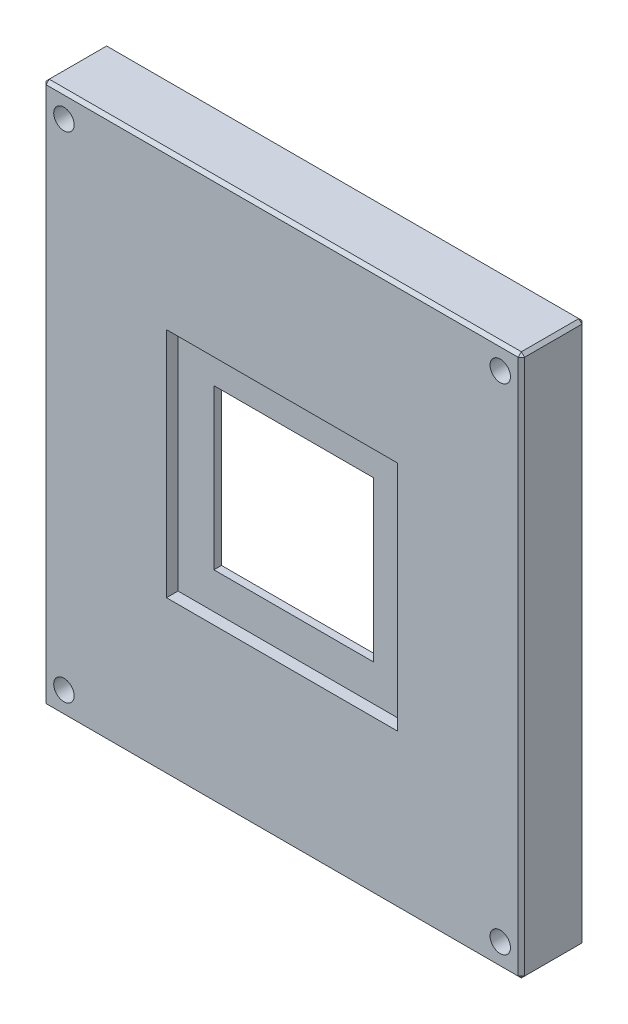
ISO-10303-21;
HEADER;
FILE_DESCRIPTION(('STEP AP214'),'2;1');
FILE_NAME('part.step','',(''),(''),'','','');
FILE_SCHEMA(('AUTOMOTIVE_DESIGN { 1 0 10303 214 1 1 1 1 }'));
ENDSEC;
DATA;
#1=APPLICATION_CONTEXT('core data for automotive mechanical design processes');
#2=APPLICATION_PROTOCOL_DEFINITION('international standard','automotive_design',2000,#1);
#3=PRODUCT_CONTEXT('',#1,'mechanical');
#4=PRODUCT('Part','Part','',(#3));
#5=PRODUCT_RELATED_PRODUCT_CATEGORY('part','',(#4));
#6=PRODUCT_DEFINITION_FORMATION('','',#4);
#7=PRODUCT_DEFINITION_CONTEXT('part definition',#1,'design');
#8=PRODUCT_DEFINITION('design','',#6,#7);
#9=PRODUCT_DEFINITION_SHAPE('','',#8);
#10=(LENGTH_UNIT() NAMED_UNIT(*) SI_UNIT(.MILLI.,.METRE.));
#11=(NAMED_UNIT(*) PLANE_ANGLE_UNIT() SI_UNIT($,.RADIAN.));
#12=(NAMED_UNIT(*) SI_UNIT($,.STERADIAN.) SOLID_ANGLE_UNIT());
#13=UNCERTAINTY_MEASURE_WITH_UNIT(LENGTH_MEASURE(1.E-05),#10,'distance_accuracy_value','');
#14=(GEOMETRIC_REPRESENTATION_CONTEXT(3) GLOBAL_UNCERTAINTY_ASSIGNED_CONTEXT((#13)) GLOBAL_UNIT_ASSIGNED_CONTEXT((#10,
#11,#12)) REPRESENTATION_CONTEXT('',''));
#15=CARTESIAN_POINT('',(0.,0.,0.));
#16=DIRECTION('',(0.,0.,1.));
#17=DIRECTION('',(1.,0.,0.));
#18=AXIS2_PLACEMENT_3D('',#15,#16,#17);
#19=CARTESIAN_POINT('',(0.,0.,10.));
#20=DIRECTION('',(0.,0.,-1.));
#21=DIRECTION('',(-1.,0.,0.));
#22=AXIS2_PLACEMENT_3D('',#19,#20,#21);
#23=PLANE('',#22);
#24=DIRECTION('',(0.,-1.,0.));
#25=VECTOR('',#24,1.);
#26=CARTESIAN_POINT('',(-37.,0.,10.));
#27=LINE('',#26,#25);
#28=CARTESIAN_POINT('',(-37.,42.,10.));
#29=VERTEX_POINT('',#28);
#30=CARTESIAN_POINT('',(-37.,-42.,10.));
#31=VERTEX_POINT('',#30);
#32=EDGE_CURVE('E304',#29,#31,#27,.T.);
#33=ORIENTED_EDGE('',*,*,#32,.T.);
#34=DIRECTION('',(1.,0.,0.));
#35=VECTOR('',#34,1.);
#36=CARTESIAN_POINT('',(0.,-42.,10.));
#37=LINE('',#36,#35);
#38=CARTESIAN_POINT('',(37.,-42.,10.));
#39=VERTEX_POINT('',#38);
#40=EDGE_CURVE('E306',#31,#39,#37,.T.);
#41=ORIENTED_EDGE('',*,*,#40,.T.);
#42=DIRECTION('',(0.,1.,0.));
#43=VECTOR('',#42,1.);
#44=CARTESIAN_POINT('',(37.,0.,10.));
#45=LINE('',#44,#43);
#46=CARTESIAN_POINT('',(37.,42.,10.));
#47=VERTEX_POINT('',#46);
#48=EDGE_CURVE('E300',#39,#47,#45,.T.);
#49=ORIENTED_EDGE('',*,*,#48,.T.);
#50=DIRECTION('',(-1.,0.,0.));
#51=VECTOR('',#50,1.);
#52=CARTESIAN_POINT('',(0.,42.,10.));
#53=LINE('',#52,#51);
#54=EDGE_CURVE('E302',#47,#29,#53,.T.);
#55=ORIENTED_EDGE('',*,*,#54,.T.);
#56=EDGE_LOOP('',(#33,#41,#49,#55));
#57=FACE_BOUND('',#56,.T.);
#58=CARTESIAN_POINT('',(34.1918918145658,38.7508107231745,10.));
#59=DIRECTION('',(0.,0.,-1.));
#60=DIRECTION('',(-1.,0.,0.));
#61=AXIS2_PLACEMENT_3D('',#58,#59,#60);
#62=CIRCLE('',#61,1.60000000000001);
#63=CARTESIAN_POINT('',(32.5918918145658,38.7508107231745,10.));
#64=VERTEX_POINT('',#63);
#65=EDGE_CURVE('E399',#64,#64,#62,.T.);
#66=ORIENTED_EDGE('',*,*,#65,.T.);
#67=EDGE_LOOP('',(#66));
#68=FACE_BOUND('',#67,.T.);
#69=CARTESIAN_POINT('',(34.1918918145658,-38.7508107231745,10.));
#70=DIRECTION('',(0.,0.,1.));
#71=DIRECTION('',(-1.,0.,0.));
#72=AXIS2_PLACEMENT_3D('',#69,#70,#71);
#73=CIRCLE('',#72,1.60000000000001);
#74=CARTESIAN_POINT('',(32.5918918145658,-38.7508107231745,10.));
#75=VERTEX_POINT('',#74);
#76=EDGE_CURVE('E410',#75,#75,#73,.T.);
#77=ORIENTED_EDGE('',*,*,#76,.F.);
#78=EDGE_LOOP('',(#77));
#79=FACE_BOUND('',#78,.T.);
#80=CARTESIAN_POINT('',(-34.1918918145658,-38.7508107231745,10.));
#81=DIRECTION('',(0.,0.,-1.));
#82=DIRECTION('',(1.,0.,0.));
#83=AXIS2_PLACEMENT_3D('',#80,#81,#82);
#84=CIRCLE('',#83,1.60000000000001);
#85=CARTESIAN_POINT('',(-32.5918918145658,-38.7508107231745,10.));
#86=VERTEX_POINT('',#85);
#87=EDGE_CURVE('E416',#86,#86,#84,.T.);
#88=ORIENTED_EDGE('',*,*,#87,.T.);
#89=EDGE_LOOP('',(#88));
#90=FACE_BOUND('',#89,.T.);
#91=CARTESIAN_POINT('',(-34.1918918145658,38.7508107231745,10.));
#92=DIRECTION('',(0.,0.,1.));
#93=DIRECTION('',(1.,0.,0.));
#94=AXIS2_PLACEMENT_3D('',#91,#92,#93);
#95=CIRCLE('',#94,1.60000000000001);
#96=CARTESIAN_POINT('',(-32.5918918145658,38.7508107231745,10.));
#97=VERTEX_POINT('',#96);
#98=EDGE_CURVE('E422',#97,#97,#95,.T.);
#99=ORIENTED_EDGE('',*,*,#98,.F.);
#100=EDGE_LOOP('',(#99));
#101=FACE_BOUND('',#100,.T.);
#102=DIRECTION('',(-1.,0.,0.));
#103=VECTOR('',#102,1.);
#104=CARTESIAN_POINT('',(-18.12,18.195,10.));
#105=LINE('',#104,#103);
#106=CARTESIAN_POINT('',(18.12,18.195,10.));
#107=VERTEX_POINT('',#106);
#108=CARTESIAN_POINT('',(-18.12,18.195,10.));
#109=VERTEX_POINT('',#108);
#110=EDGE_CURVE('E224',#107,#109,#105,.T.);
#111=ORIENTED_EDGE('',*,*,#110,.F.);
#112=DIRECTION('',(0.,1.,0.));
#113=VECTOR('',#112,1.);
#114=CARTESIAN_POINT('',(18.12,-18.195,10.));
#115=LINE('',#114,#113);
#116=CARTESIAN_POINT('',(18.12,-18.195,10.));
#117=VERTEX_POINT('',#116);
#118=EDGE_CURVE('E195',#117,#107,#115,.T.);
#119=ORIENTED_EDGE('',*,*,#118,.F.);
#120=DIRECTION('',(1.,0.,0.));
#121=VECTOR('',#120,1.);
#122=CARTESIAN_POINT('',(-18.12,-18.195,10.));
#123=LINE('',#122,#121);
#124=CARTESIAN_POINT('',(-18.12,-18.195,10.));
#125=VERTEX_POINT('',#124);
#126=EDGE_CURVE('E212',#125,#117,#123,.T.);
#127=ORIENTED_EDGE('',*,*,#126,.F.);
#128=DIRECTION('',(0.,-1.,0.));
#129=VECTOR('',#128,1.);
#130=CARTESIAN_POINT('',(-18.12,-18.195,10.));
#131=LINE('',#130,#129);
#132=EDGE_CURVE('E215',#109,#125,#131,.T.);
#133=ORIENTED_EDGE('',*,*,#132,.F.);
#134=EDGE_LOOP('',(#111,#119,#127,#133));
#135=FACE_BOUND('',#134,.T.);
#136=ADVANCED_FACE('F39',(#57,#68,#79,#90,#101,#135),#23,.F.);
#137=CARTESIAN_POINT('',(0.,0.,0.));
#138=DIRECTION('',(0.,0.,-1.));
#139=DIRECTION('',(-1.,0.,0.));
#140=AXIS2_PLACEMENT_3D('',#137,#138,#139);
#141=PLANE('',#140);
#142=DIRECTION('',(0.,-1.,0.));
#143=VECTOR('',#142,1.);
#144=CARTESIAN_POINT('',(37.,-42.5,0.));
#145=LINE('',#144,#143);
#146=CARTESIAN_POINT('',(37.,42.,0.));
#147=VERTEX_POINT('',#146);
#148=CARTESIAN_POINT('',(37.,-42.,0.));
#149=VERTEX_POINT('',#148);
#150=EDGE_CURVE('E291',#147,#149,#145,.T.);
#151=ORIENTED_EDGE('',*,*,#150,.T.);
#152=DIRECTION('',(-1.,0.,0.));
#153=VECTOR('',#152,1.);
#154=CARTESIAN_POINT('',(-37.5,-42.,0.));
#155=LINE('',#154,#153);
#156=CARTESIAN_POINT('',(-37.,-42.,0.));
#157=VERTEX_POINT('',#156);
#158=EDGE_CURVE('E297',#149,#157,#155,.T.);
#159=ORIENTED_EDGE('',*,*,#158,.T.);
#160=DIRECTION('',(0.,1.,0.));
#161=VECTOR('',#160,1.);
#162=CARTESIAN_POINT('',(-37.,42.5,0.));
#163=LINE('',#162,#161);
#164=CARTESIAN_POINT('',(-37.,42.,0.));
#165=VERTEX_POINT('',#164);
#166=EDGE_CURVE('E295',#157,#165,#163,.T.);
#167=ORIENTED_EDGE('',*,*,#166,.T.);
#168=DIRECTION('',(1.,0.,0.));
#169=VECTOR('',#168,1.);
#170=CARTESIAN_POINT('',(37.5,42.,0.));
#171=LINE('',#170,#169);
#172=EDGE_CURVE('E293',#165,#147,#171,.T.);
#173=ORIENTED_EDGE('',*,*,#172,.T.);
#174=EDGE_LOOP('',(#151,#159,#167,#173));
#175=FACE_BOUND('',#174,.T.);
#176=CARTESIAN_POINT('',(34.1918918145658,38.7508107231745,0.));
#177=DIRECTION('',(0.,0.,-1.));
#178=DIRECTION('',(-1.,0.,0.));
#179=AXIS2_PLACEMENT_3D('',#176,#177,#178);
#180=CIRCLE('',#179,1.60000000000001);
#181=CARTESIAN_POINT('',(32.5918918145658,38.7508107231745,0.));
#182=VERTEX_POINT('',#181);
#183=EDGE_CURVE('E405',#182,#182,#180,.T.);
#184=ORIENTED_EDGE('',*,*,#183,.F.);
#185=EDGE_LOOP('',(#184));
#186=FACE_BOUND('',#185,.T.);
#187=CARTESIAN_POINT('',(34.1918918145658,-38.7508107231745,0.));
#188=DIRECTION('',(0.,0.,1.));
#189=DIRECTION('',(-1.,0.,0.));
#190=AXIS2_PLACEMENT_3D('',#187,#188,#189);
#191=CIRCLE('',#190,1.60000000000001);
#192=CARTESIAN_POINT('',(32.5918918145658,-38.7508107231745,0.));
#193=VERTEX_POINT('',#192);
#194=EDGE_CURVE('E413',#193,#193,#191,.T.);
#195=ORIENTED_EDGE('',*,*,#194,.T.);
#196=EDGE_LOOP('',(#195));
#197=FACE_BOUND('',#196,.T.);
#198=CARTESIAN_POINT('',(-34.1918918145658,-38.7508107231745,0.));
#199=DIRECTION('',(0.,0.,-1.));
#200=DIRECTION('',(1.,0.,0.));
#201=AXIS2_PLACEMENT_3D('',#198,#199,#200);
#202=CIRCLE('',#201,1.60000000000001);
#203=CARTESIAN_POINT('',(-32.5918918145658,-38.7508107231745,0.));
#204=VERTEX_POINT('',#203);
#205=EDGE_CURVE('E419',#204,#204,#202,.T.);
#206=ORIENTED_EDGE('',*,*,#205,.F.);
#207=EDGE_LOOP('',(#206));
#208=FACE_BOUND('',#207,.T.);
#209=CARTESIAN_POINT('',(-34.1918918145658,38.7508107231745,0.));
#210=DIRECTION('',(0.,0.,1.));
#211=DIRECTION('',(1.,0.,0.));
#212=AXIS2_PLACEMENT_3D('',#209,#210,#211);
#213=CIRCLE('',#212,1.60000000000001);
#214=CARTESIAN_POINT('',(-32.5918918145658,38.7508107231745,0.));
#215=VERTEX_POINT('',#214);
#216=EDGE_CURVE('E425',#215,#215,#213,.T.);
#217=ORIENTED_EDGE('',*,*,#216,.T.);
#218=EDGE_LOOP('',(#217));
#219=FACE_BOUND('',#218,.T.);
#220=DIRECTION('',(0.,-1.,0.));
#221=VECTOR('',#220,1.);
#222=CARTESIAN_POINT('',(-19.5,0.,0.));
#223=LINE('',#222,#221);
#224=CARTESIAN_POINT('',(-19.5,19.5,0.));
#225=VERTEX_POINT('',#224);
#226=CARTESIAN_POINT('',(-19.5,-19.5,0.));
#227=VERTEX_POINT('',#226);
#228=EDGE_CURVE('E254',#225,#227,#223,.T.);
#229=ORIENTED_EDGE('',*,*,#228,.T.);
#230=DIRECTION('',(1.,0.,0.));
#231=VECTOR('',#230,1.);
#232=CARTESIAN_POINT('',(0.,-19.5,0.));
#233=LINE('',#232,#231);
#234=CARTESIAN_POINT('',(19.5,-19.5,0.));
#235=VERTEX_POINT('',#234);
#236=EDGE_CURVE('E260',#227,#235,#233,.T.);
#237=ORIENTED_EDGE('',*,*,#236,.T.);
#238=DIRECTION('',(0.,1.,0.));
#239=VECTOR('',#238,1.);
#240=CARTESIAN_POINT('',(19.5,0.,0.));
#241=LINE('',#240,#239);
#242=CARTESIAN_POINT('',(19.5,19.5,0.));
#243=VERTEX_POINT('',#242);
#244=EDGE_CURVE('E258',#235,#243,#241,.T.);
#245=ORIENTED_EDGE('',*,*,#244,.T.);
#246=DIRECTION('',(-1.,0.,0.));
#247=VECTOR('',#246,1.);
#248=CARTESIAN_POINT('',(0.,19.5,0.));
#249=LINE('',#248,#247);
#250=EDGE_CURVE('E256',#243,#225,#249,.T.);
#251=ORIENTED_EDGE('',*,*,#250,.T.);
#252=EDGE_LOOP('',(#229,#237,#245,#251));
#253=FACE_BOUND('',#252,.T.);
#254=ADVANCED_FACE('F455',(#175,#186,#197,#208,#219,#253),#141,.T.);
#255=CARTESIAN_POINT('',(37.5,-42.5,10.));
#256=DIRECTION('',(-1.,0.,0.));
#257=DIRECTION('',(0.,0.,1.));
#258=AXIS2_PLACEMENT_3D('',#255,#256,#257);
#259=PLANE('',#258);
#260=DIRECTION('',(0.,1.,0.));
#261=VECTOR('',#260,1.);
#262=CARTESIAN_POINT('',(37.5,42.5,0.500000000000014));
#263=LINE('',#262,#261);
#264=CARTESIAN_POINT('',(37.5,-42.,0.500000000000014));
#265=VERTEX_POINT('',#264);
#266=CARTESIAN_POINT('',(37.5,42.,0.500000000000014));
#267=VERTEX_POINT('',#266);
#268=EDGE_CURVE('E49',#265,#267,#263,.T.);
#269=ORIENTED_EDGE('',*,*,#268,.T.);
#270=DIRECTION('',(0.,0.,1.));
#271=VECTOR('',#270,1.);
#272=CARTESIAN_POINT('',(37.5,42.,10.));
#273=LINE('',#272,#271);
#274=CARTESIAN_POINT('',(37.5,42.,9.49999999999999));
#275=VERTEX_POINT('',#274);
#276=EDGE_CURVE('E11',#267,#275,#273,.T.);
#277=ORIENTED_EDGE('',*,*,#276,.T.);
#278=DIRECTION('',(0.,-1.,0.));
#279=VECTOR('',#278,1.);
#280=CARTESIAN_POINT('',(37.5,-42.5,9.49999999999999));
#281=LINE('',#280,#279);
#282=CARTESIAN_POINT('',(37.5,-42.,9.49999999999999));
#283=VERTEX_POINT('',#282);
#284=EDGE_CURVE('E327',#275,#283,#281,.T.);
#285=ORIENTED_EDGE('',*,*,#284,.T.);
#286=DIRECTION('',(0.,0.,-1.));
#287=VECTOR('',#286,1.);
#288=CARTESIAN_POINT('',(37.5,-42.,10.));
#289=LINE('',#288,#287);
#290=EDGE_CURVE('E60',#283,#265,#289,.T.);
#291=ORIENTED_EDGE('',*,*,#290,.T.);
#292=EDGE_LOOP('',(#269,#277,#285,#291));
#293=FACE_BOUND('',#292,.T.);
#294=ADVANCED_FACE('F461',(#293),#259,.F.);
#295=CARTESIAN_POINT('',(-37.5,42.5,10.));
#296=DIRECTION('',(0.,-1.,0.));
#297=DIRECTION('',(0.,0.,-1.));
#298=AXIS2_PLACEMENT_3D('',#295,#296,#297);
#299=PLANE('',#298);
#300=DIRECTION('',(0.,0.,1.));
#301=VECTOR('',#300,1.);
#302=CARTESIAN_POINT('',(-37.,42.5,10.));
#303=LINE('',#302,#301);
#304=CARTESIAN_POINT('',(-37.,42.5,0.500000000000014));
#305=VERTEX_POINT('',#304);
#306=CARTESIAN_POINT('',(-37.,42.5,9.49999999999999));
#307=VERTEX_POINT('',#306);
#308=EDGE_CURVE('E322',#305,#307,#303,.T.);
#309=ORIENTED_EDGE('',*,*,#308,.T.);
#310=DIRECTION('',(1.,0.,0.));
#311=VECTOR('',#310,1.);
#312=CARTESIAN_POINT('',(-37.5,42.5,9.49999999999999));
#313=LINE('',#312,#311);
#314=CARTESIAN_POINT('',(37.,42.5,9.49999999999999));
#315=VERTEX_POINT('',#314);
#316=EDGE_CURVE('E324',#307,#315,#313,.T.);
#317=ORIENTED_EDGE('',*,*,#316,.T.);
#318=DIRECTION('',(0.,0.,-1.));
#319=VECTOR('',#318,1.);
#320=CARTESIAN_POINT('',(37.,42.5,10.));
#321=LINE('',#320,#319);
#322=CARTESIAN_POINT('',(37.,42.5,0.500000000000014));
#323=VERTEX_POINT('',#322);
#324=EDGE_CURVE('E318',#315,#323,#321,.T.);
#325=ORIENTED_EDGE('',*,*,#324,.T.);
#326=DIRECTION('',(-1.,0.,0.));
#327=VECTOR('',#326,1.);
#328=CARTESIAN_POINT('',(-37.5,42.5,0.500000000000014));
#329=LINE('',#328,#327);
#330=EDGE_CURVE('E320',#323,#305,#329,.T.);
#331=ORIENTED_EDGE('',*,*,#330,.T.);
#332=EDGE_LOOP('',(#309,#317,#325,#331));
#333=FACE_BOUND('',#332,.T.);
#334=ADVANCED_FACE('F450',(#333),#299,.F.);
#335=CARTESIAN_POINT('',(-37.5,-42.5,10.));
#336=DIRECTION('',(1.,0.,0.));
#337=DIRECTION('',(0.,0.,-1.));
#338=AXIS2_PLACEMENT_3D('',#335,#336,#337);
#339=PLANE('',#338);
#340=DIRECTION('',(0.,-1.,0.));
#341=VECTOR('',#340,1.);
#342=CARTESIAN_POINT('',(-37.5,-42.5,0.500000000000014));
#343=LINE('',#342,#341);
#344=CARTESIAN_POINT('',(-37.5,42.,0.500000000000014));
#345=VERTEX_POINT('',#344);
#346=CARTESIAN_POINT('',(-37.5,-42.,0.500000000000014));
#347=VERTEX_POINT('',#346);
#348=EDGE_CURVE('E311',#345,#347,#343,.T.);
#349=ORIENTED_EDGE('',*,*,#348,.T.);
#350=DIRECTION('',(0.,0.,1.));
#351=VECTOR('',#350,1.);
#352=CARTESIAN_POINT('',(-37.5,-42.,10.));
#353=LINE('',#352,#351);
#354=CARTESIAN_POINT('',(-37.5,-42.,9.49999999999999));
#355=VERTEX_POINT('',#354);
#356=EDGE_CURVE('E315',#347,#355,#353,.T.);
#357=ORIENTED_EDGE('',*,*,#356,.T.);
#358=DIRECTION('',(0.,1.,0.));
#359=VECTOR('',#358,1.);
#360=CARTESIAN_POINT('',(-37.5,-42.5,9.49999999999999));
#361=LINE('',#360,#359);
#362=CARTESIAN_POINT('',(-37.5,42.,9.49999999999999));
#363=VERTEX_POINT('',#362);
#364=EDGE_CURVE('E313',#355,#363,#361,.T.);
#365=ORIENTED_EDGE('',*,*,#364,.T.);
#366=DIRECTION('',(0.,0.,-1.));
#367=VECTOR('',#366,1.);
#368=CARTESIAN_POINT('',(-37.5,42.,10.));
#369=LINE('',#368,#367);
#370=EDGE_CURVE('E309',#363,#345,#369,.T.);
#371=ORIENTED_EDGE('',*,*,#370,.T.);
#372=EDGE_LOOP('',(#349,#357,#365,#371));
#373=FACE_BOUND('',#372,.T.);
#374=ADVANCED_FACE('F440',(#373),#339,.F.);
#375=CARTESIAN_POINT('',(-37.5,-42.5,10.));
#376=DIRECTION('',(0.,1.,0.));
#377=DIRECTION('',(0.,0.,1.));
#378=AXIS2_PLACEMENT_3D('',#375,#376,#377);
#379=PLANE('',#378);
#380=DIRECTION('',(-1.,0.,0.));
#381=VECTOR('',#380,1.);
#382=CARTESIAN_POINT('',(-37.5,-42.5,9.49999999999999));
#383=LINE('',#382,#381);
#384=CARTESIAN_POINT('',(37.,-42.5,9.49999999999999));
#385=VERTEX_POINT('',#384);
#386=CARTESIAN_POINT('',(-37.,-42.5,9.49999999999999));
#387=VERTEX_POINT('',#386);
#388=EDGE_CURVE('E284',#385,#387,#383,.T.);
#389=ORIENTED_EDGE('',*,*,#388,.T.);
#390=DIRECTION('',(0.,0.,-1.));
#391=VECTOR('',#390,1.);
#392=CARTESIAN_POINT('',(-37.,-42.5,10.));
#393=LINE('',#392,#391);
#394=CARTESIAN_POINT('',(-37.,-42.5,0.500000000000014));
#395=VERTEX_POINT('',#394);
#396=EDGE_CURVE('E289',#387,#395,#393,.T.);
#397=ORIENTED_EDGE('',*,*,#396,.T.);
#398=DIRECTION('',(1.,0.,0.));
#399=VECTOR('',#398,1.);
#400=CARTESIAN_POINT('',(37.5,-42.5,0.500000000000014));
#401=LINE('',#400,#399);
#402=CARTESIAN_POINT('',(37.,-42.5,0.500000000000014));
#403=VERTEX_POINT('',#402);
#404=EDGE_CURVE('E286',#395,#403,#401,.T.);
#405=ORIENTED_EDGE('',*,*,#404,.T.);
#406=DIRECTION('',(0.,0.,1.));
#407=VECTOR('',#406,1.);
#408=CARTESIAN_POINT('',(37.,-42.5,10.));
#409=LINE('',#408,#407);
#410=EDGE_CURVE('E272',#403,#385,#409,.T.);
#411=ORIENTED_EDGE('',*,*,#410,.T.);
#412=EDGE_LOOP('',(#389,#397,#405,#411));
#413=FACE_BOUND('',#412,.T.);
#414=CARTESIAN_POINT('',(0.,-42.5,5.));
#415=DIRECTION('',(0.,-1.,0.));
#416=DIRECTION('',(0.,0.,-1.));
#417=AXIS2_PLACEMENT_3D('',#414,#415,#416);
#418=CIRCLE('',#417,2.8);
#419=CARTESIAN_POINT('',(0.,-42.5,2.2));
#420=VERTEX_POINT('',#419);
#421=EDGE_CURVE('E218',#420,#420,#418,.T.);
#422=ORIENTED_EDGE('',*,*,#421,.F.);
#423=EDGE_LOOP('',(#422));
#424=FACE_BOUND('',#423,.T.);
#425=ADVANCED_FACE('F437',(#413,#424),#379,.F.);
#426=CARTESIAN_POINT('',(12.5,-12.5,10.));
#427=DIRECTION('',(-1.,0.,0.));
#428=DIRECTION('',(0.,0.,1.));
#429=AXIS2_PLACEMENT_3D('',#426,#427,#428);
#430=PLANE('',#429);
#431=DIRECTION('',(0.,0.,-1.));
#432=VECTOR('',#431,1.);
#433=CARTESIAN_POINT('',(12.5,12.5,10.));
#434=LINE('',#433,#432);
#435=CARTESIAN_POINT('',(12.5,12.5,8.19));
#436=VERTEX_POINT('',#435);
#437=CARTESIAN_POINT('',(12.5,12.5,7.00000000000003));
#438=VERTEX_POINT('',#437);
#439=EDGE_CURVE('E249',#436,#438,#434,.T.);
#440=ORIENTED_EDGE('',*,*,#439,.T.);
#441=DIRECTION('',(0.,-1.,0.));
#442=VECTOR('',#441,1.);
#443=CARTESIAN_POINT('',(12.5,-12.5,7.00000000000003));
#444=LINE('',#443,#442);
#445=CARTESIAN_POINT('',(12.5,-12.5,7.00000000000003));
#446=VERTEX_POINT('',#445);
#447=EDGE_CURVE('E266',#438,#446,#444,.T.);
#448=ORIENTED_EDGE('',*,*,#447,.T.);
#449=DIRECTION('',(0.,0.,-1.));
#450=VECTOR('',#449,1.);
#451=CARTESIAN_POINT('',(12.5,-12.5,10.));
#452=LINE('',#451,#450);
#453=CARTESIAN_POINT('',(12.5,-12.5,8.19));
#454=VERTEX_POINT('',#453);
#455=EDGE_CURVE('E240',#454,#446,#452,.T.);
#456=ORIENTED_EDGE('',*,*,#455,.F.);
#457=DIRECTION('',(0.,-1.,0.));
#458=VECTOR('',#457,1.);
#459=CARTESIAN_POINT('',(12.5,-12.5,8.19));
#460=LINE('',#459,#458);
#461=EDGE_CURVE('E238',#436,#454,#460,.T.);
#462=ORIENTED_EDGE('',*,*,#461,.F.);
#463=EDGE_LOOP('',(#440,#448,#456,#462));
#464=FACE_BOUND('',#463,.T.);
#465=ADVANCED_FACE('F439',(#464),#430,.T.);
#466=CARTESIAN_POINT('',(-12.5,12.5,10.));
#467=DIRECTION('',(0.,-1.,0.));
#468=DIRECTION('',(0.,0.,-1.));
#469=AXIS2_PLACEMENT_3D('',#466,#467,#468);
#470=PLANE('',#469);
#471=DIRECTION('',(0.,0.,-1.));
#472=VECTOR('',#471,1.);
#473=CARTESIAN_POINT('',(-12.5,12.5,10.));
#474=LINE('',#473,#472);
#475=CARTESIAN_POINT('',(-12.5,12.5,8.19));
#476=VERTEX_POINT('',#475);
#477=CARTESIAN_POINT('',(-12.5,12.5,7.00000000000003));
#478=VERTEX_POINT('',#477);
#479=EDGE_CURVE('E246',#476,#478,#474,.T.);
#480=ORIENTED_EDGE('',*,*,#479,.T.);
#481=DIRECTION('',(1.,0.,0.));
#482=VECTOR('',#481,1.);
#483=CARTESIAN_POINT('',(-12.5,12.5,7.00000000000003));
#484=LINE('',#483,#482);
#485=EDGE_CURVE('E268',#478,#438,#484,.T.);
#486=ORIENTED_EDGE('',*,*,#485,.T.);
#487=ORIENTED_EDGE('',*,*,#439,.F.);
#488=DIRECTION('',(1.,0.,0.));
#489=VECTOR('',#488,1.);
#490=CARTESIAN_POINT('',(-12.5,12.5,8.19));
#491=LINE('',#490,#489);
#492=EDGE_CURVE('E236',#476,#436,#491,.T.);
#493=ORIENTED_EDGE('',*,*,#492,.F.);
#494=EDGE_LOOP('',(#480,#486,#487,#493));
#495=FACE_BOUND('',#494,.T.);
#496=ADVANCED_FACE('F447',(#495),#470,.T.);
#497=CARTESIAN_POINT('',(-12.5,-12.5,10.));
#498=DIRECTION('',(1.,0.,0.));
#499=DIRECTION('',(0.,0.,-1.));
#500=AXIS2_PLACEMENT_3D('',#497,#498,#499);
#501=PLANE('',#500);
#502=DIRECTION('',(0.,0.,-1.));
#503=VECTOR('',#502,1.);
#504=CARTESIAN_POINT('',(-12.5,-12.5,10.));
#505=LINE('',#504,#503);
#506=CARTESIAN_POINT('',(-12.5,-12.5,8.19));
#507=VERTEX_POINT('',#506);
#508=CARTESIAN_POINT('',(-12.5,-12.5,7.00000000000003));
#509=VERTEX_POINT('',#508);
#510=EDGE_CURVE('E243',#507,#509,#505,.T.);
#511=ORIENTED_EDGE('',*,*,#510,.T.);
#512=DIRECTION('',(0.,1.,0.));
#513=VECTOR('',#512,1.);
#514=CARTESIAN_POINT('',(-12.5,-12.5,7.00000000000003));
#515=LINE('',#514,#513);
#516=EDGE_CURVE('E270',#509,#478,#515,.T.);
#517=ORIENTED_EDGE('',*,*,#516,.T.);
#518=ORIENTED_EDGE('',*,*,#479,.F.);
#519=DIRECTION('',(0.,1.,0.));
#520=VECTOR('',#519,1.);
#521=CARTESIAN_POINT('',(-12.5,-12.5,8.19));
#522=LINE('',#521,#520);
#523=EDGE_CURVE('E231',#507,#476,#522,.T.);
#524=ORIENTED_EDGE('',*,*,#523,.F.);
#525=EDGE_LOOP('',(#511,#517,#518,#524));
#526=FACE_BOUND('',#525,.T.);
#527=ADVANCED_FACE('F466',(#526),#501,.T.);
#528=CARTESIAN_POINT('',(-12.5,-12.5,10.));
#529=DIRECTION('',(0.,1.,0.));
#530=DIRECTION('',(0.,0.,1.));
#531=AXIS2_PLACEMENT_3D('',#528,#529,#530);
#532=PLANE('',#531);
#533=ORIENTED_EDGE('',*,*,#455,.T.);
#534=DIRECTION('',(-1.,0.,0.));
#535=VECTOR('',#534,1.);
#536=CARTESIAN_POINT('',(-12.5,-12.5,7.00000000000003));
#537=LINE('',#536,#535);
#538=EDGE_CURVE('E263',#446,#509,#537,.T.);
#539=ORIENTED_EDGE('',*,*,#538,.T.);
#540=ORIENTED_EDGE('',*,*,#510,.F.);
#541=DIRECTION('',(-1.,0.,0.));
#542=VECTOR('',#541,1.);
#543=CARTESIAN_POINT('',(-12.5,-12.5,8.19));
#544=LINE('',#543,#542);
#545=EDGE_CURVE('E252',#454,#507,#544,.T.);
#546=ORIENTED_EDGE('',*,*,#545,.F.);
#547=EDGE_LOOP('',(#533,#539,#540,#546));
#548=FACE_BOUND('',#547,.T.);
#549=ADVANCED_FACE('F470',(#548),#532,.T.);
#550=CARTESIAN_POINT('',(18.12,-18.195,8.19));
#551=DIRECTION('',(1.,0.,0.));
#552=DIRECTION('',(0.,0.,-1.));
#553=AXIS2_PLACEMENT_3D('',#550,#551,#552);
#554=PLANE('',#553);
#555=ORIENTED_EDGE('',*,*,#118,.T.);
#556=DIRECTION('',(0.,0.,1.));
#557=VECTOR('',#556,1.);
#558=CARTESIAN_POINT('',(18.12,18.195,8.19));
#559=LINE('',#558,#557);
#560=CARTESIAN_POINT('',(18.12,18.195,8.19));
#561=VERTEX_POINT('',#560);
#562=EDGE_CURVE('E188',#561,#107,#559,.T.);
#563=ORIENTED_EDGE('',*,*,#562,.F.);
#564=DIRECTION('',(0.,1.,0.));
#565=VECTOR('',#564,1.);
#566=CARTESIAN_POINT('',(18.12,-18.195,8.19));
#567=LINE('',#566,#565);
#568=CARTESIAN_POINT('',(18.12,-18.195,8.19));
#569=VERTEX_POINT('',#568);
#570=EDGE_CURVE('E192',#569,#561,#567,.T.);
#571=ORIENTED_EDGE('',*,*,#570,.F.);
#572=DIRECTION('',(0.,0.,1.));
#573=VECTOR('',#572,1.);
#574=CARTESIAN_POINT('',(18.12,-18.195,8.19));
#575=LINE('',#574,#573);
#576=EDGE_CURVE('E229',#569,#117,#575,.T.);
#577=ORIENTED_EDGE('',*,*,#576,.T.);
#578=EDGE_LOOP('',(#555,#563,#571,#577));
#579=FACE_BOUND('',#578,.T.);
#580=ADVANCED_FACE('F190',(#579),#554,.F.);
#581=CARTESIAN_POINT('',(-18.12,-18.195,8.19));
#582=DIRECTION('',(0.,-1.,0.));
#583=DIRECTION('',(0.,0.,-1.));
#584=AXIS2_PLACEMENT_3D('',#581,#582,#583);
#585=PLANE('',#584);
#586=ORIENTED_EDGE('',*,*,#126,.T.);
#587=ORIENTED_EDGE('',*,*,#576,.F.);
#588=DIRECTION('',(1.,0.,0.));
#589=VECTOR('',#588,1.);
#590=CARTESIAN_POINT('',(-18.12,-18.195,8.19));
#591=LINE('',#590,#589);
#592=CARTESIAN_POINT('',(-18.12,-18.195,8.19));
#593=VERTEX_POINT('',#592);
#594=EDGE_CURVE('E200',#593,#569,#591,.T.);
#595=ORIENTED_EDGE('',*,*,#594,.F.);
#596=DIRECTION('',(0.,0.,1.));
#597=VECTOR('',#596,1.);
#598=CARTESIAN_POINT('',(-18.12,-18.195,8.19));
#599=LINE('',#598,#597);
#600=EDGE_CURVE('E232',#593,#125,#599,.T.);
#601=ORIENTED_EDGE('',*,*,#600,.T.);
#602=EDGE_LOOP('',(#586,#587,#595,#601));
#603=FACE_BOUND('',#602,.T.);
#604=ADVANCED_FACE('F477',(#603),#585,.F.);
#605=CARTESIAN_POINT('',(-18.12,-18.195,8.19));
#606=DIRECTION('',(-1.,0.,0.));
#607=DIRECTION('',(0.,0.,1.));
#608=AXIS2_PLACEMENT_3D('',#605,#606,#607);
#609=PLANE('',#608);
#610=ORIENTED_EDGE('',*,*,#132,.T.);
#611=ORIENTED_EDGE('',*,*,#600,.F.);
#612=DIRECTION('',(0.,-1.,0.));
#613=VECTOR('',#612,1.);
#614=CARTESIAN_POINT('',(-18.12,-18.195,8.19));
#615=LINE('',#614,#613);
#616=CARTESIAN_POINT('',(-18.12,18.195,8.19));
#617=VERTEX_POINT('',#616);
#618=EDGE_CURVE('E208',#617,#593,#615,.T.);
#619=ORIENTED_EDGE('',*,*,#618,.F.);
#620=DIRECTION('',(0.,0.,1.));
#621=VECTOR('',#620,1.);
#622=CARTESIAN_POINT('',(-18.12,18.195,8.19));
#623=LINE('',#622,#621);
#624=EDGE_CURVE('E199',#617,#109,#623,.T.);
#625=ORIENTED_EDGE('',*,*,#624,.T.);
#626=EDGE_LOOP('',(#610,#611,#619,#625));
#627=FACE_BOUND('',#626,.T.);
#628=ADVANCED_FACE('F480',(#627),#609,.F.);
#629=CARTESIAN_POINT('',(-18.12,18.195,8.19));
#630=DIRECTION('',(0.,1.,0.));
#631=DIRECTION('',(0.,0.,1.));
#632=AXIS2_PLACEMENT_3D('',#629,#630,#631);
#633=PLANE('',#632);
#634=ORIENTED_EDGE('',*,*,#110,.T.);
#635=ORIENTED_EDGE('',*,*,#624,.F.);
#636=DIRECTION('',(-1.,0.,0.));
#637=VECTOR('',#636,1.);
#638=CARTESIAN_POINT('',(-18.12,18.195,8.19));
#639=LINE('',#638,#637);
#640=EDGE_CURVE('E203',#561,#617,#639,.T.);
#641=ORIENTED_EDGE('',*,*,#640,.F.);
#642=ORIENTED_EDGE('',*,*,#562,.T.);
#643=EDGE_LOOP('',(#634,#635,#641,#642));
#644=FACE_BOUND('',#643,.T.);
#645=ADVANCED_FACE('F204',(#644),#633,.F.);
#646=CARTESIAN_POINT('',(0.,0.,8.19));
#647=DIRECTION('',(0.,0.,-1.));
#648=DIRECTION('',(-1.,0.,0.));
#649=AXIS2_PLACEMENT_3D('',#646,#647,#648);
#650=PLANE('',#649);
#651=ORIENTED_EDGE('',*,*,#461,.T.);
#652=ORIENTED_EDGE('',*,*,#545,.T.);
#653=ORIENTED_EDGE('',*,*,#523,.T.);
#654=ORIENTED_EDGE('',*,*,#492,.T.);
#655=EDGE_LOOP('',(#651,#652,#653,#654));
#656=FACE_BOUND('',#655,.T.);
#657=ORIENTED_EDGE('',*,*,#570,.T.);
#658=ORIENTED_EDGE('',*,*,#640,.T.);
#659=ORIENTED_EDGE('',*,*,#618,.T.);
#660=ORIENTED_EDGE('',*,*,#594,.T.);
#661=EDGE_LOOP('',(#657,#658,#659,#660));
#662=FACE_BOUND('',#661,.T.);
#663=ADVANCED_FACE('F210',(#656,#662),#650,.F.);
#664=CARTESIAN_POINT('',(0.,19.5,0.));
#665=DIRECTION('',(0.,0.707106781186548,0.707106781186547));
#666=DIRECTION('',(-1.,0.,0.));
#667=AXIS2_PLACEMENT_3D('',#664,#665,#666);
#668=PLANE('',#667);
#669=DIRECTION('',(-0.577350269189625,-0.577350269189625,0.577350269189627));
#670=VECTOR('',#669,1.);
#671=CARTESIAN_POINT('',(13.,13.,6.50000000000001));
#672=LINE('',#671,#670);
#673=EDGE_CURVE('E278',#438,#243,#672,.F.);
#674=ORIENTED_EDGE('',*,*,#673,.F.);
#675=ORIENTED_EDGE('',*,*,#485,.F.);
#676=DIRECTION('',(0.577350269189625,-0.577350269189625,0.577350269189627));
#677=VECTOR('',#676,1.);
#678=CARTESIAN_POINT('',(-13.,13.,6.50000000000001));
#679=LINE('',#678,#677);
#680=EDGE_CURVE('E225',#225,#478,#679,.T.);
#681=ORIENTED_EDGE('',*,*,#680,.F.);
#682=ORIENTED_EDGE('',*,*,#250,.F.);
#683=EDGE_LOOP('',(#674,#675,#681,#682));
#684=FACE_BOUND('',#683,.T.);
#685=ADVANCED_FACE('F489',(#684),#668,.F.);
#686=CARTESIAN_POINT('',(-19.5,0.,0.));
#687=DIRECTION('',(-0.707106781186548,0.,0.707106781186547));
#688=DIRECTION('',(0.,-1.,0.));
#689=AXIS2_PLACEMENT_3D('',#686,#687,#688);
#690=PLANE('',#689);
#691=ORIENTED_EDGE('',*,*,#680,.T.);
#692=ORIENTED_EDGE('',*,*,#516,.F.);
#693=DIRECTION('',(-0.577350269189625,-0.577350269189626,-0.577350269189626));
#694=VECTOR('',#693,1.);
#695=CARTESIAN_POINT('',(-13.,-13.,6.50000000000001));
#696=LINE('',#695,#694);
#697=EDGE_CURVE('E275',#227,#509,#696,.F.);
#698=ORIENTED_EDGE('',*,*,#697,.F.);
#699=ORIENTED_EDGE('',*,*,#228,.F.);
#700=EDGE_LOOP('',(#691,#692,#698,#699));
#701=FACE_BOUND('',#700,.T.);
#702=ADVANCED_FACE('F535',(#701),#690,.F.);
#703=CARTESIAN_POINT('',(19.5,0.,0.));
#704=DIRECTION('',(0.707106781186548,0.,0.707106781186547));
#705=DIRECTION('',(0.,1.,0.));
#706=AXIS2_PLACEMENT_3D('',#703,#704,#705);
#707=PLANE('',#706);
#708=ORIENTED_EDGE('',*,*,#673,.T.);
#709=ORIENTED_EDGE('',*,*,#244,.F.);
#710=DIRECTION('',(-0.577350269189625,0.577350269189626,0.577350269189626));
#711=VECTOR('',#710,1.);
#712=CARTESIAN_POINT('',(13.,-13.,6.50000000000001));
#713=LINE('',#712,#711);
#714=EDGE_CURVE('E273',#446,#235,#713,.F.);
#715=ORIENTED_EDGE('',*,*,#714,.F.);
#716=ORIENTED_EDGE('',*,*,#447,.F.);
#717=EDGE_LOOP('',(#708,#709,#715,#716));
#718=FACE_BOUND('',#717,.T.);
#719=ADVANCED_FACE('F542',(#718),#707,.F.);
#720=CARTESIAN_POINT('',(0.,-19.5,0.));
#721=DIRECTION('',(0.,-0.707106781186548,0.707106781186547));
#722=DIRECTION('',(1.,0.,0.));
#723=AXIS2_PLACEMENT_3D('',#720,#721,#722);
#724=PLANE('',#723);
#725=ORIENTED_EDGE('',*,*,#697,.T.);
#726=ORIENTED_EDGE('',*,*,#538,.F.);
#727=ORIENTED_EDGE('',*,*,#714,.T.);
#728=ORIENTED_EDGE('',*,*,#236,.F.);
#729=EDGE_LOOP('',(#725,#726,#727,#728));
#730=FACE_BOUND('',#729,.T.);
#731=ADVANCED_FACE('F494',(#730),#724,.F.);
#732=CARTESIAN_POINT('',(0.,-32.5,5.));
#733=DIRECTION('',(0.,-1.,0.));
#734=DIRECTION('',(0.,0.,-1.));
#735=AXIS2_PLACEMENT_3D('',#732,#733,#734);
#736=CYLINDRICAL_SURFACE('',#735,2.8);
#737=CARTESIAN_POINT('',(0.,-32.5,5.));
#738=DIRECTION('',(0.,-1.,0.));
#739=DIRECTION('',(0.,0.,-1.));
#740=AXIS2_PLACEMENT_3D('',#737,#738,#739);
#741=CIRCLE('',#740,2.8);
#742=CARTESIAN_POINT('',(0.,-32.5,2.2));
#743=VERTEX_POINT('',#742);
#744=EDGE_CURVE('E276',#743,#743,#741,.T.);
#745=ORIENTED_EDGE('',*,*,#744,.F.);
#746=EDGE_LOOP('',(#745));
#747=FACE_BOUND('',#746,.T.);
#748=ORIENTED_EDGE('',*,*,#421,.T.);
#749=EDGE_LOOP('',(#748));
#750=FACE_BOUND('',#749,.T.);
#751=ADVANCED_FACE('F435',(#747,#750),#736,.F.);
#752=CARTESIAN_POINT('',(0.,-32.5,5.));
#753=DIRECTION('',(0.,-1.,0.));
#754=DIRECTION('',(0.,0.,-1.));
#755=AXIS2_PLACEMENT_3D('',#752,#753,#754);
#756=PLANE('',#755);
#757=ORIENTED_EDGE('',*,*,#744,.T.);
#758=EDGE_LOOP('',(#757));
#759=FACE_BOUND('',#758,.T.);
#760=ADVANCED_FACE('F493',(#759),#756,.T.);
#761=CARTESIAN_POINT('',(-34.1918918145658,38.7508107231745,0.));
#762=DIRECTION('',(0.,0.,1.));
#763=DIRECTION('',(1.,0.,0.));
#764=AXIS2_PLACEMENT_3D('',#761,#762,#763);
#765=CYLINDRICAL_SURFACE('',#764,1.60000000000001);
#766=ORIENTED_EDGE('',*,*,#216,.F.);
#767=EDGE_LOOP('',(#766));
#768=FACE_BOUND('',#767,.T.);
#769=ORIENTED_EDGE('',*,*,#98,.T.);
#770=EDGE_LOOP('',(#769));
#771=FACE_BOUND('',#770,.T.);
#772=ADVANCED_FACE('F498',(#768,#771),#765,.F.);
#773=CARTESIAN_POINT('',(-34.1918918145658,-38.7508107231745,0.));
#774=DIRECTION('',(0.,0.,1.));
#775=DIRECTION('',(1.,0.,0.));
#776=AXIS2_PLACEMENT_3D('',#773,#774,#775);
#777=CYLINDRICAL_SURFACE('',#776,1.60000000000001);
#778=ORIENTED_EDGE('',*,*,#205,.T.);
#779=EDGE_LOOP('',(#778));
#780=FACE_BOUND('',#779,.T.);
#781=ORIENTED_EDGE('',*,*,#87,.F.);
#782=EDGE_LOOP('',(#781));
#783=FACE_BOUND('',#782,.T.);
#784=ADVANCED_FACE('F501',(#780,#783),#777,.F.);
#785=CARTESIAN_POINT('',(34.1918918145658,-38.7508107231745,0.));
#786=DIRECTION('',(0.,0.,1.));
#787=DIRECTION('',(1.,0.,0.));
#788=AXIS2_PLACEMENT_3D('',#785,#786,#787);
#789=CYLINDRICAL_SURFACE('',#788,1.60000000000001);
#790=ORIENTED_EDGE('',*,*,#194,.F.);
#791=EDGE_LOOP('',(#790));
#792=FACE_BOUND('',#791,.T.);
#793=ORIENTED_EDGE('',*,*,#76,.T.);
#794=EDGE_LOOP('',(#793));
#795=FACE_BOUND('',#794,.T.);
#796=ADVANCED_FACE('F505',(#792,#795),#789,.F.);
#797=CARTESIAN_POINT('',(34.1918918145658,38.7508107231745,0.));
#798=DIRECTION('',(0.,0.,1.));
#799=DIRECTION('',(1.,0.,0.));
#800=AXIS2_PLACEMENT_3D('',#797,#798,#799);
#801=CYLINDRICAL_SURFACE('',#800,1.60000000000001);
#802=ORIENTED_EDGE('',*,*,#183,.T.);
#803=EDGE_LOOP('',(#802));
#804=FACE_BOUND('',#803,.T.);
#805=ORIENTED_EDGE('',*,*,#65,.F.);
#806=EDGE_LOOP('',(#805));
#807=FACE_BOUND('',#806,.T.);
#808=ADVANCED_FACE('F509',(#804,#807),#801,.F.);
#809=CARTESIAN_POINT('',(0.,42.,10.));
#810=DIRECTION('',(0.,-0.707106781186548,-0.707106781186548));
#811=DIRECTION('',(-1.,0.,0.));
#812=AXIS2_PLACEMENT_3D('',#809,#810,#811);
#813=PLANE('',#812);
#814=DIRECTION('',(0.,-0.707106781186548,0.707106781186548));
#815=VECTOR('',#814,1.);
#816=CARTESIAN_POINT('',(-37.,42.25,9.74999999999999));
#817=LINE('',#816,#815);
#818=EDGE_CURVE('E44',#29,#307,#817,.F.);
#819=ORIENTED_EDGE('',*,*,#818,.F.);
#820=ORIENTED_EDGE('',*,*,#54,.F.);
#821=DIRECTION('',(0.,0.707106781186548,-0.707106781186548));
#822=VECTOR('',#821,1.);
#823=CARTESIAN_POINT('',(37.,42.5,9.49999999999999));
#824=LINE('',#823,#822);
#825=EDGE_CURVE('E392',#315,#47,#824,.F.);
#826=ORIENTED_EDGE('',*,*,#825,.F.);
#827=ORIENTED_EDGE('',*,*,#316,.F.);
#828=EDGE_LOOP('',(#819,#820,#826,#827));
#829=FACE_BOUND('',#828,.T.);
#830=ADVANCED_FACE('F42',(#829),#813,.F.);
#831=CARTESIAN_POINT('',(-37.5,42.,9.49999999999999));
#832=DIRECTION('',(-0.577350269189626,0.577350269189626,0.577350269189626));
#833=DIRECTION('',(0.707106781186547,0.,0.707106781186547));
#834=AXIS2_PLACEMENT_3D('',#831,#832,#833);
#835=PLANE('',#834);
#836=DIRECTION('',(-0.707106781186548,0.,-0.707106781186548));
#837=VECTOR('',#836,1.);
#838=CARTESIAN_POINT('',(-37.5,42.,9.49999999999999));
#839=LINE('',#838,#837);
#840=EDGE_CURVE('E387',#29,#363,#839,.T.);
#841=ORIENTED_EDGE('',*,*,#840,.F.);
#842=ORIENTED_EDGE('',*,*,#818,.T.);
#843=DIRECTION('',(0.707106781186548,0.707106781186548,0.));
#844=VECTOR('',#843,1.);
#845=CARTESIAN_POINT('',(-37.5,42.,9.49999999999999));
#846=LINE('',#845,#844);
#847=EDGE_CURVE('E390',#363,#307,#846,.T.);
#848=ORIENTED_EDGE('',*,*,#847,.F.);
#849=EDGE_LOOP('',(#841,#842,#848));
#850=FACE_BOUND('',#849,.T.);
#851=ADVANCED_FACE('F516',(#850),#835,.T.);
#852=CARTESIAN_POINT('',(37.,42.5,9.49999999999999));
#853=DIRECTION('',(0.577350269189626,0.577350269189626,0.577350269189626));
#854=DIRECTION('',(0.707106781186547,0.,-0.707106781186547));
#855=AXIS2_PLACEMENT_3D('',#852,#853,#854);
#856=PLANE('',#855);
#857=DIRECTION('',(0.707106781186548,-0.707106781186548,0.));
#858=VECTOR('',#857,1.);
#859=CARTESIAN_POINT('',(37.,42.5,9.49999999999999));
#860=LINE('',#859,#858);
#861=EDGE_CURVE('E381',#315,#275,#860,.T.);
#862=ORIENTED_EDGE('',*,*,#861,.F.);
#863=ORIENTED_EDGE('',*,*,#825,.T.);
#864=DIRECTION('',(-0.707106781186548,0.,0.707106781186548));
#865=VECTOR('',#864,1.);
#866=CARTESIAN_POINT('',(37.25,42.,9.74999999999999));
#867=LINE('',#866,#865);
#868=EDGE_CURVE('E384',#275,#47,#867,.T.);
#869=ORIENTED_EDGE('',*,*,#868,.F.);
#870=EDGE_LOOP('',(#862,#863,#869));
#871=FACE_BOUND('',#870,.T.);
#872=ADVANCED_FACE('F685',(#871),#856,.T.);
#873=CARTESIAN_POINT('',(-37.5,42.,10.));
#874=DIRECTION('',(0.707106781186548,-0.707106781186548,0.));
#875=DIRECTION('',(0.,0.,-1.));
#876=AXIS2_PLACEMENT_3D('',#873,#874,#875);
#877=PLANE('',#876);
#878=ORIENTED_EDGE('',*,*,#847,.T.);
#879=ORIENTED_EDGE('',*,*,#308,.F.);
#880=DIRECTION('',(-0.707106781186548,-0.707106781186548,0.));
#881=VECTOR('',#880,1.);
#882=CARTESIAN_POINT('',(-37.25,42.25,0.500000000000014));
#883=LINE('',#882,#881);
#884=EDGE_CURVE('E375',#345,#305,#883,.F.);
#885=ORIENTED_EDGE('',*,*,#884,.F.);
#886=ORIENTED_EDGE('',*,*,#370,.F.);
#887=EDGE_LOOP('',(#878,#879,#885,#886));
#888=FACE_BOUND('',#887,.T.);
#889=ADVANCED_FACE('F678',(#888),#877,.F.);
#890=CARTESIAN_POINT('',(-37.,0.,10.));
#891=DIRECTION('',(0.707106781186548,0.,-0.707106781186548));
#892=DIRECTION('',(0.,-1.,0.));
#893=AXIS2_PLACEMENT_3D('',#890,#891,#892);
#894=PLANE('',#893);
#895=ORIENTED_EDGE('',*,*,#840,.T.);
#896=ORIENTED_EDGE('',*,*,#364,.F.);
#897=DIRECTION('',(0.707106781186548,0.,0.707106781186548));
#898=VECTOR('',#897,1.);
#899=CARTESIAN_POINT('',(-37.25,-42.,9.74999999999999));
#900=LINE('',#899,#898);
#901=EDGE_CURVE('E372',#31,#355,#900,.F.);
#902=ORIENTED_EDGE('',*,*,#901,.F.);
#903=ORIENTED_EDGE('',*,*,#32,.F.);
#904=EDGE_LOOP('',(#895,#896,#902,#903));
#905=FACE_BOUND('',#904,.T.);
#906=ADVANCED_FACE('F671',(#905),#894,.F.);
#907=CARTESIAN_POINT('',(0.,-42.,10.));
#908=DIRECTION('',(0.,0.707106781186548,-0.707106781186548));
#909=DIRECTION('',(1.,0.,0.));
#910=AXIS2_PLACEMENT_3D('',#907,#908,#909);
#911=PLANE('',#910);
#912=DIRECTION('',(0.,0.707106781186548,0.707106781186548));
#913=VECTOR('',#912,1.);
#914=CARTESIAN_POINT('',(37.,-42.,10.));
#915=LINE('',#914,#913);
#916=EDGE_CURVE('E366',#39,#385,#915,.F.);
#917=ORIENTED_EDGE('',*,*,#916,.F.);
#918=ORIENTED_EDGE('',*,*,#40,.F.);
#919=DIRECTION('',(0.,-0.707106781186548,-0.707106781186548));
#920=VECTOR('',#919,1.);
#921=CARTESIAN_POINT('',(-37.,-42.5,9.49999999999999));
#922=LINE('',#921,#920);
#923=EDGE_CURVE('E369',#387,#31,#922,.F.);
#924=ORIENTED_EDGE('',*,*,#923,.F.);
#925=ORIENTED_EDGE('',*,*,#388,.F.);
#926=EDGE_LOOP('',(#917,#918,#924,#925));
#927=FACE_BOUND('',#926,.T.);
#928=ADVANCED_FACE('F664',(#927),#911,.F.);
#929=CARTESIAN_POINT('',(37.,0.,10.));
#930=DIRECTION('',(-0.707106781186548,0.,-0.707106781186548));
#931=DIRECTION('',(0.,1.,0.));
#932=AXIS2_PLACEMENT_3D('',#929,#930,#931);
#933=PLANE('',#932);
#934=ORIENTED_EDGE('',*,*,#868,.T.);
#935=ORIENTED_EDGE('',*,*,#48,.F.);
#936=DIRECTION('',(0.707106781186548,0.,-0.707106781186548));
#937=VECTOR('',#936,1.);
#938=CARTESIAN_POINT('',(37.,-42.,10.));
#939=LINE('',#938,#937);
#940=EDGE_CURVE('E364',#283,#39,#939,.F.);
#941=ORIENTED_EDGE('',*,*,#940,.F.);
#942=ORIENTED_EDGE('',*,*,#284,.F.);
#943=EDGE_LOOP('',(#934,#935,#941,#942));
#944=FACE_BOUND('',#943,.T.);
#945=ADVANCED_FACE('F657',(#944),#933,.F.);
#946=CARTESIAN_POINT('',(37.,42.5,10.));
#947=DIRECTION('',(-0.707106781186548,-0.707106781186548,0.));
#948=DIRECTION('',(0.,0.,-1.));
#949=AXIS2_PLACEMENT_3D('',#946,#947,#948);
#950=PLANE('',#949);
#951=ORIENTED_EDGE('',*,*,#861,.T.);
#952=ORIENTED_EDGE('',*,*,#276,.F.);
#953=DIRECTION('',(-0.707106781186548,0.707106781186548,0.));
#954=VECTOR('',#953,1.);
#955=CARTESIAN_POINT('',(37.25,42.25,0.500000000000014));
#956=LINE('',#955,#954);
#957=EDGE_CURVE('E361',#323,#267,#956,.F.);
#958=ORIENTED_EDGE('',*,*,#957,.F.);
#959=ORIENTED_EDGE('',*,*,#324,.F.);
#960=EDGE_LOOP('',(#951,#952,#958,#959));
#961=FACE_BOUND('',#960,.T.);
#962=ADVANCED_FACE('F650',(#961),#950,.F.);
#963=CARTESIAN_POINT('',(-37.5,42.5,0.500000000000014));
#964=DIRECTION('',(0.,0.707106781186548,-0.707106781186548));
#965=DIRECTION('',(1.,0.,0.));
#966=AXIS2_PLACEMENT_3D('',#963,#964,#965);
#967=PLANE('',#966);
#968=DIRECTION('',(0.,-0.707106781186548,-0.707106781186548));
#969=VECTOR('',#968,1.);
#970=CARTESIAN_POINT('',(-37.,42.,0.));
#971=LINE('',#970,#969);
#972=EDGE_CURVE('E378',#305,#165,#971,.T.);
#973=ORIENTED_EDGE('',*,*,#972,.F.);
#974=ORIENTED_EDGE('',*,*,#330,.F.);
#975=DIRECTION('',(0.,0.707106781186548,0.707106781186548));
#976=VECTOR('',#975,1.);
#977=CARTESIAN_POINT('',(37.,42.,0.));
#978=LINE('',#977,#976);
#979=EDGE_CURVE('E358',#147,#323,#978,.T.);
#980=ORIENTED_EDGE('',*,*,#979,.F.);
#981=ORIENTED_EDGE('',*,*,#172,.F.);
#982=EDGE_LOOP('',(#973,#974,#980,#981));
#983=FACE_BOUND('',#982,.T.);
#984=ADVANCED_FACE('F643',(#983),#967,.T.);
#985=CARTESIAN_POINT('',(-37.,42.,0.));
#986=DIRECTION('',(-0.577350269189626,0.577350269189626,-0.577350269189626));
#987=DIRECTION('',(-0.707106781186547,0.,0.707106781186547));
#988=AXIS2_PLACEMENT_3D('',#985,#986,#987);
#989=PLANE('',#988);
#990=ORIENTED_EDGE('',*,*,#884,.T.);
#991=ORIENTED_EDGE('',*,*,#972,.T.);
#992=DIRECTION('',(-0.707106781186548,0.,0.707106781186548));
#993=VECTOR('',#992,1.);
#994=CARTESIAN_POINT('',(-37.,42.,0.));
#995=LINE('',#994,#993);
#996=EDGE_CURVE('E355',#345,#165,#995,.F.);
#997=ORIENTED_EDGE('',*,*,#996,.F.);
#998=EDGE_LOOP('',(#990,#991,#997));
#999=FACE_BOUND('',#998,.T.);
#1000=ADVANCED_FACE('F636',(#999),#989,.T.);
#1001=CARTESIAN_POINT('',(-37.,-42.5,9.49999999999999));
#1002=DIRECTION('',(-0.577350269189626,-0.577350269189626,0.577350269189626));
#1003=DIRECTION('',(0.707106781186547,0.,0.707106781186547));
#1004=AXIS2_PLACEMENT_3D('',#1001,#1002,#1003);
#1005=PLANE('',#1004);
#1006=ORIENTED_EDGE('',*,*,#923,.T.);
#1007=ORIENTED_EDGE('',*,*,#901,.T.);
#1008=DIRECTION('',(-0.707106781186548,0.707106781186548,0.));
#1009=VECTOR('',#1008,1.);
#1010=CARTESIAN_POINT('',(-37.,-42.5,9.49999999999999));
#1011=LINE('',#1010,#1009);
#1012=EDGE_CURVE('E353',#387,#355,#1011,.T.);
#1013=ORIENTED_EDGE('',*,*,#1012,.F.);
#1014=EDGE_LOOP('',(#1006,#1007,#1013));
#1015=FACE_BOUND('',#1014,.T.);
#1016=ADVANCED_FACE('F629',(#1015),#1005,.T.);
#1017=CARTESIAN_POINT('',(37.,-42.,10.));
#1018=DIRECTION('',(0.577350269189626,-0.577350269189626,0.577350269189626));
#1019=DIRECTION('',(0.707106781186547,0.,-0.707106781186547));
#1020=AXIS2_PLACEMENT_3D('',#1017,#1018,#1019);
#1021=PLANE('',#1020);
#1022=ORIENTED_EDGE('',*,*,#940,.T.);
#1023=ORIENTED_EDGE('',*,*,#916,.T.);
#1024=DIRECTION('',(-0.707106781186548,-0.707106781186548,0.));
#1025=VECTOR('',#1024,1.);
#1026=CARTESIAN_POINT('',(37.25,-42.25,9.49999999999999));
#1027=LINE('',#1026,#1025);
#1028=EDGE_CURVE('E350',#283,#385,#1027,.T.);
#1029=ORIENTED_EDGE('',*,*,#1028,.F.);
#1030=EDGE_LOOP('',(#1022,#1023,#1029));
#1031=FACE_BOUND('',#1030,.T.);
#1032=ADVANCED_FACE('F622',(#1031),#1021,.T.);
#1033=CARTESIAN_POINT('',(37.,42.,0.));
#1034=DIRECTION('',(0.577350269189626,0.577350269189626,-0.577350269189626));
#1035=DIRECTION('',(-0.707106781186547,0.,-0.707106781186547));
#1036=AXIS2_PLACEMENT_3D('',#1033,#1034,#1035);
#1037=PLANE('',#1036);
#1038=ORIENTED_EDGE('',*,*,#979,.T.);
#1039=ORIENTED_EDGE('',*,*,#957,.T.);
#1040=DIRECTION('',(-0.707106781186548,0.,-0.707106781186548));
#1041=VECTOR('',#1040,1.);
#1042=CARTESIAN_POINT('',(37.,42.,0.));
#1043=LINE('',#1042,#1041);
#1044=EDGE_CURVE('E347',#147,#267,#1043,.F.);
#1045=ORIENTED_EDGE('',*,*,#1044,.F.);
#1046=EDGE_LOOP('',(#1038,#1039,#1045));
#1047=FACE_BOUND('',#1046,.T.);
#1048=ADVANCED_FACE('F615',(#1047),#1037,.T.);
#1049=CARTESIAN_POINT('',(-37.5,-42.5,0.500000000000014));
#1050=DIRECTION('',(-0.707106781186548,0.,-0.707106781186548));
#1051=DIRECTION('',(0.,1.,0.));
#1052=AXIS2_PLACEMENT_3D('',#1049,#1050,#1051);
#1053=PLANE('',#1052);
#1054=ORIENTED_EDGE('',*,*,#996,.T.);
#1055=ORIENTED_EDGE('',*,*,#166,.F.);
#1056=DIRECTION('',(0.707106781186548,0.,-0.707106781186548));
#1057=VECTOR('',#1056,1.);
#1058=CARTESIAN_POINT('',(-37.,-42.,0.));
#1059=LINE('',#1058,#1057);
#1060=EDGE_CURVE('E344',#347,#157,#1059,.T.);
#1061=ORIENTED_EDGE('',*,*,#1060,.F.);
#1062=ORIENTED_EDGE('',*,*,#348,.F.);
#1063=EDGE_LOOP('',(#1054,#1055,#1061,#1062));
#1064=FACE_BOUND('',#1063,.T.);
#1065=ADVANCED_FACE('F608',(#1064),#1053,.T.);
#1066=CARTESIAN_POINT('',(-37.,-42.5,10.));
#1067=DIRECTION('',(0.707106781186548,0.707106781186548,0.));
#1068=DIRECTION('',(0.,0.,-1.));
#1069=AXIS2_PLACEMENT_3D('',#1066,#1067,#1068);
#1070=PLANE('',#1069);
#1071=ORIENTED_EDGE('',*,*,#1012,.T.);
#1072=ORIENTED_EDGE('',*,*,#356,.F.);
#1073=DIRECTION('',(0.707106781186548,-0.707106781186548,0.));
#1074=VECTOR('',#1073,1.);
#1075=CARTESIAN_POINT('',(-37.25,-42.25,0.500000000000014));
#1076=LINE('',#1075,#1074);
#1077=EDGE_CURVE('E341',#395,#347,#1076,.F.);
#1078=ORIENTED_EDGE('',*,*,#1077,.F.);
#1079=ORIENTED_EDGE('',*,*,#396,.F.);
#1080=EDGE_LOOP('',(#1071,#1072,#1078,#1079));
#1081=FACE_BOUND('',#1080,.T.);
#1082=ADVANCED_FACE('F601',(#1081),#1070,.F.);
#1083=CARTESIAN_POINT('',(37.5,-42.,10.));
#1084=DIRECTION('',(-0.707106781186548,0.707106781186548,0.));
#1085=DIRECTION('',(0.,0.,-1.));
#1086=AXIS2_PLACEMENT_3D('',#1083,#1084,#1085);
#1087=PLANE('',#1086);
#1088=ORIENTED_EDGE('',*,*,#1028,.T.);
#1089=ORIENTED_EDGE('',*,*,#410,.F.);
#1090=DIRECTION('',(0.707106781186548,0.707106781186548,0.));
#1091=VECTOR('',#1090,1.);
#1092=CARTESIAN_POINT('',(37.,-42.5,0.500000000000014));
#1093=LINE('',#1092,#1091);
#1094=EDGE_CURVE('E338',#265,#403,#1093,.F.);
#1095=ORIENTED_EDGE('',*,*,#1094,.F.);
#1096=ORIENTED_EDGE('',*,*,#290,.F.);
#1097=EDGE_LOOP('',(#1088,#1089,#1095,#1096));
#1098=FACE_BOUND('',#1097,.T.);
#1099=ADVANCED_FACE('F594',(#1098),#1087,.F.);
#1100=CARTESIAN_POINT('',(37.5,-42.5,0.500000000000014));
#1101=DIRECTION('',(0.707106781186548,0.,-0.707106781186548));
#1102=DIRECTION('',(0.,-1.,0.));
#1103=AXIS2_PLACEMENT_3D('',#1100,#1101,#1102);
#1104=PLANE('',#1103);
#1105=ORIENTED_EDGE('',*,*,#1044,.T.);
#1106=ORIENTED_EDGE('',*,*,#268,.F.);
#1107=DIRECTION('',(0.707106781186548,0.,0.707106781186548));
#1108=VECTOR('',#1107,1.);
#1109=CARTESIAN_POINT('',(37.25,-42.,0.250000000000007));
#1110=LINE('',#1109,#1108);
#1111=EDGE_CURVE('E335',#149,#265,#1110,.T.);
#1112=ORIENTED_EDGE('',*,*,#1111,.F.);
#1113=ORIENTED_EDGE('',*,*,#150,.F.);
#1114=EDGE_LOOP('',(#1105,#1106,#1112,#1113));
#1115=FACE_BOUND('',#1114,.T.);
#1116=ADVANCED_FACE('F587',(#1115),#1104,.T.);
#1117=CARTESIAN_POINT('',(-37.,-42.,0.));
#1118=DIRECTION('',(-0.577350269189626,-0.577350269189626,-0.577350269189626));
#1119=DIRECTION('',(-0.707106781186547,0.,0.707106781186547));
#1120=AXIS2_PLACEMENT_3D('',#1117,#1118,#1119);
#1121=PLANE('',#1120);
#1122=ORIENTED_EDGE('',*,*,#1077,.T.);
#1123=ORIENTED_EDGE('',*,*,#1060,.T.);
#1124=DIRECTION('',(0.,-0.707106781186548,0.707106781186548));
#1125=VECTOR('',#1124,1.);
#1126=CARTESIAN_POINT('',(-37.,-42.,0.));
#1127=LINE('',#1126,#1125);
#1128=EDGE_CURVE('E333',#395,#157,#1127,.F.);
#1129=ORIENTED_EDGE('',*,*,#1128,.F.);
#1130=EDGE_LOOP('',(#1122,#1123,#1129));
#1131=FACE_BOUND('',#1130,.T.);
#1132=ADVANCED_FACE('F580',(#1131),#1121,.T.);
#1133=CARTESIAN_POINT('',(37.,-42.5,0.500000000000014));
#1134=DIRECTION('',(0.577350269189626,-0.577350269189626,-0.577350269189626));
#1135=DIRECTION('',(-0.707106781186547,0.,-0.707106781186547));
#1136=AXIS2_PLACEMENT_3D('',#1133,#1134,#1135);
#1137=PLANE('',#1136);
#1138=ORIENTED_EDGE('',*,*,#1111,.T.);
#1139=ORIENTED_EDGE('',*,*,#1094,.T.);
#1140=DIRECTION('',(0.,0.707106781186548,-0.707106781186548));
#1141=VECTOR('',#1140,1.);
#1142=CARTESIAN_POINT('',(37.,-42.5,0.500000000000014));
#1143=LINE('',#1142,#1141);
#1144=EDGE_CURVE('E331',#149,#403,#1143,.F.);
#1145=ORIENTED_EDGE('',*,*,#1144,.F.);
#1146=EDGE_LOOP('',(#1138,#1139,#1145));
#1147=FACE_BOUND('',#1146,.T.);
#1148=ADVANCED_FACE('F573',(#1147),#1137,.T.);
#1149=CARTESIAN_POINT('',(-37.5,-42.5,0.500000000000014));
#1150=DIRECTION('',(0.,-0.707106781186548,-0.707106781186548));
#1151=DIRECTION('',(-1.,0.,0.));
#1152=AXIS2_PLACEMENT_3D('',#1149,#1150,#1151);
#1153=PLANE('',#1152);
#1154=ORIENTED_EDGE('',*,*,#1128,.T.);
#1155=ORIENTED_EDGE('',*,*,#158,.F.);
#1156=ORIENTED_EDGE('',*,*,#1144,.T.);
#1157=ORIENTED_EDGE('',*,*,#404,.F.);
#1158=EDGE_LOOP('',(#1154,#1155,#1156,#1157));
#1159=FACE_BOUND('',#1158,.T.);
#1160=ADVANCED_FACE('F567',(#1159),#1153,.T.);
#1161=CLOSED_SHELL('',(#136,#254,#294,#334,#374,#425,#465,#496,#527,#549,#580,#604,#628,#645,
#663,#685,#702,#719,#731,#751,#760,#772,#784,#796,#808,#830,#851,#872,#889,#906,#928,#945,#962,
#984,#1000,#1016,#1032,#1048,#1065,#1082,#1099,#1116,#1132,#1148,#1160));
#1162=MANIFOLD_SOLID_BREP('B2',#1161);
#1163=ADVANCED_BREP_SHAPE_REPRESENTATION('',(#18,#1162),#14);
#1164=SHAPE_DEFINITION_REPRESENTATION(#9,#1163);
ENDSEC;
END-ISO-10303-21;
